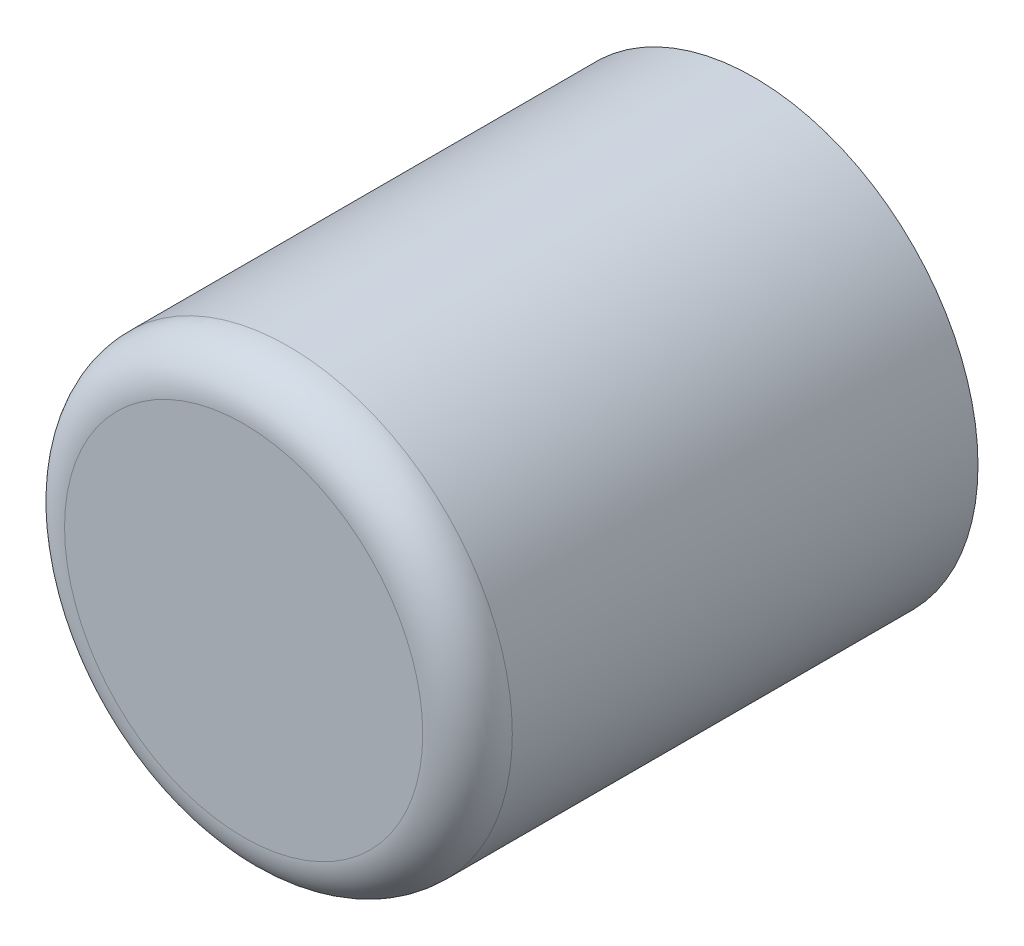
ISO-10303-21;
HEADER;
FILE_DESCRIPTION(('STEP AP214'),'2;1');
FILE_NAME('part.step','',(''),(''),'','','');
FILE_SCHEMA(('AUTOMOTIVE_DESIGN { 1 0 10303 214 1 1 1 1 }'));
ENDSEC;
DATA;
#1=APPLICATION_CONTEXT('core data for automotive mechanical design processes');
#2=APPLICATION_PROTOCOL_DEFINITION('international standard','automotive_design',2000,#1);
#3=PRODUCT_CONTEXT('',#1,'mechanical');
#4=PRODUCT('Part','Part','',(#3));
#5=PRODUCT_RELATED_PRODUCT_CATEGORY('part','',(#4));
#6=PRODUCT_DEFINITION_FORMATION('','',#4);
#7=PRODUCT_DEFINITION_CONTEXT('part definition',#1,'design');
#8=PRODUCT_DEFINITION('design','',#6,#7);
#9=PRODUCT_DEFINITION_SHAPE('','',#8);
#10=(LENGTH_UNIT() NAMED_UNIT(*) SI_UNIT(.MILLI.,.METRE.));
#11=(NAMED_UNIT(*) PLANE_ANGLE_UNIT() SI_UNIT($,.RADIAN.));
#12=(NAMED_UNIT(*) SI_UNIT($,.STERADIAN.) SOLID_ANGLE_UNIT());
#13=UNCERTAINTY_MEASURE_WITH_UNIT(LENGTH_MEASURE(1.E-05),#10,'distance_accuracy_value','');
#14=(GEOMETRIC_REPRESENTATION_CONTEXT(3) GLOBAL_UNCERTAINTY_ASSIGNED_CONTEXT((#13)) GLOBAL_UNIT_ASSIGNED_CONTEXT((#10,
#11,#12)) REPRESENTATION_CONTEXT('',''));
#15=CARTESIAN_POINT('',(0.,0.,0.));
#16=DIRECTION('',(0.,0.,1.));
#17=DIRECTION('',(1.,0.,0.));
#18=AXIS2_PLACEMENT_3D('',#15,#16,#17);
#19=CARTESIAN_POINT('',(0.,0.,14.478));
#20=DIRECTION('',(0.,0.,-1.));
#21=DIRECTION('',(-1.,0.,0.));
#22=AXIS2_PLACEMENT_3D('',#19,#20,#21);
#23=CYLINDRICAL_SURFACE('',#22,6.35);
#24=CARTESIAN_POINT('',(0.,0.,13.208));
#25=DIRECTION('',(0.,0.,1.));
#26=DIRECTION('',(1.,0.,0.));
#27=AXIS2_PLACEMENT_3D('',#24,#25,#26);
#28=CIRCLE('',#27,6.35);
#29=CARTESIAN_POINT('',(6.35,0.,13.208));
#30=VERTEX_POINT('',#29);
#31=EDGE_CURVE('E10',#30,#30,#28,.F.);
#32=ORIENTED_EDGE('',*,*,#31,.T.);
#33=EDGE_LOOP('',(#32));
#34=FACE_BOUND('',#33,.T.);
#35=CARTESIAN_POINT('',(0.,0.,0.));
#36=DIRECTION('',(0.,0.,1.));
#37=DIRECTION('',(1.,0.,0.));
#38=AXIS2_PLACEMENT_3D('',#35,#36,#37);
#39=CIRCLE('',#38,6.35);
#40=CARTESIAN_POINT('',(6.35,0.,0.));
#41=VERTEX_POINT('',#40);
#42=EDGE_CURVE('E37',#41,#41,#39,.T.);
#43=ORIENTED_EDGE('',*,*,#42,.T.);
#44=EDGE_LOOP('',(#43));
#45=FACE_BOUND('',#44,.T.);
#46=ADVANCED_FACE('F27',(#34,#45),#23,.T.);
#47=CARTESIAN_POINT('',(0.,0.,14.478));
#48=DIRECTION('',(0.,0.,1.));
#49=DIRECTION('',(1.,0.,0.));
#50=AXIS2_PLACEMENT_3D('',#47,#48,#49);
#51=PLANE('',#50);
#52=CARTESIAN_POINT('',(0.,0.,14.478));
#53=DIRECTION('',(0.,0.,1.));
#54=DIRECTION('',(1.,0.,0.));
#55=AXIS2_PLACEMENT_3D('',#52,#53,#54);
#56=CIRCLE('',#55,5.08);
#57=CARTESIAN_POINT('',(5.08,0.,14.478));
#58=VERTEX_POINT('',#57);
#59=EDGE_CURVE('E33',#58,#58,#56,.T.);
#60=ORIENTED_EDGE('',*,*,#59,.T.);
#61=EDGE_LOOP('',(#60));
#62=FACE_BOUND('',#61,.T.);
#63=ADVANCED_FACE('F48',(#62),#51,.T.);
#64=CARTESIAN_POINT('',(0.,0.,0.));
#65=DIRECTION('',(0.,0.,1.));
#66=DIRECTION('',(1.,0.,0.));
#67=AXIS2_PLACEMENT_3D('',#64,#65,#66);
#68=PLANE('',#67);
#69=ORIENTED_EDGE('',*,*,#42,.F.);
#70=EDGE_LOOP('',(#69));
#71=FACE_BOUND('',#70,.T.);
#72=ADVANCED_FACE('F45',(#71),#68,.F.);
#73=CARTESIAN_POINT('',(0.,0.,13.208));
#74=DIRECTION('',(0.,0.,1.));
#75=DIRECTION('',(1.,0.,0.));
#76=AXIS2_PLACEMENT_3D('',#73,#74,#75);
#77=TOROIDAL_SURFACE('',#76,5.08,1.27);
#78=ORIENTED_EDGE('',*,*,#31,.F.);
#79=EDGE_LOOP('',(#78));
#80=FACE_BOUND('',#79,.T.);
#81=ORIENTED_EDGE('',*,*,#59,.F.);
#82=EDGE_LOOP('',(#81));
#83=FACE_BOUND('',#82,.T.);
#84=ADVANCED_FACE('F47',(#80,#83),#77,.T.);
#85=CLOSED_SHELL('',(#46,#63,#72,#84));
#86=MANIFOLD_SOLID_BREP('B2',#85);
#87=ADVANCED_BREP_SHAPE_REPRESENTATION('',(#18,#86),#14);
#88=SHAPE_DEFINITION_REPRESENTATION(#9,#87);
ENDSEC;
END-ISO-10303-21;
